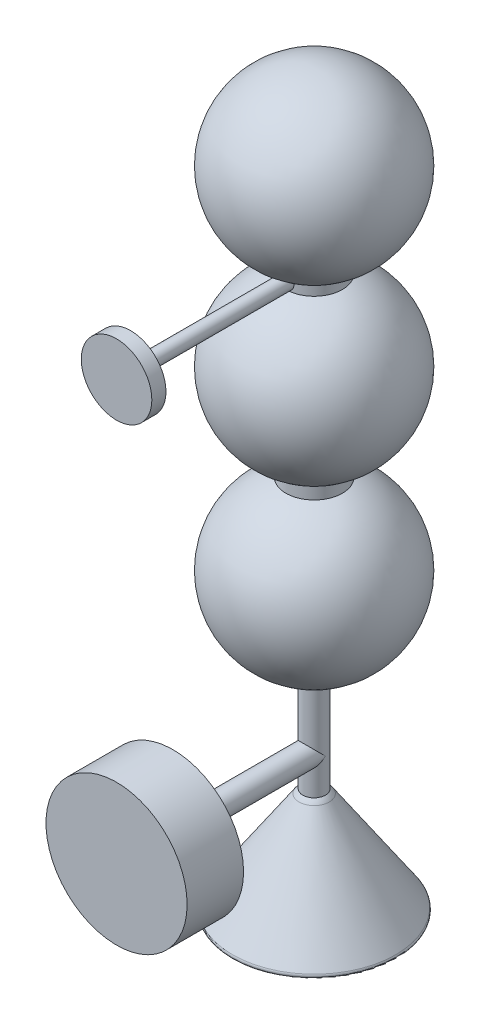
from build123d import *

# Parameters (mm, degrees)
CROQUIS2_R              = 8
SALIENTE_EXTRUIR2_DEPTH = 150
CROQUIS6_W              = 20
CROQUIS6_H              = 10
MATRIZL1_COUNT          = 2
MATRIZL1_PITCH          = 125
CROQUIS8_R              = 8
SALIENTE_EXTRUIR3_DEPTH = 100
CROQUIS9_R              = 50
SALIENTE_EXTRUIR4_DEPTH = 40
CROQUIS10_R             = 5
SALIENTE_EXTRUIR5_DEPTH = 130
CROQUIS11_R             = 25
SALIENTE_EXTRUIR6_DEPTH = 10
REDONDEO2_R             = 2


with BuildPart() as part:
    # Croquis2 → Saliente-Extruir2 (new body)
    with BuildSketch(Plane(origin=(0, 0, 0), x_dir=(1, 0, 0), z_dir=(0, 1, 0))):
        with Locations(Location((0, 0, 0), (0, 0, 270))):
            Circle(CROQUIS2_R)
    extrude(amount=SALIENTE_EXTRUIR2_DEPTH)

    # Croquis8 → Saliente-Extruir3 (add)
    with BuildSketch(Plane.XY):
        with Locations((0, 100)):
            Circle(CROQUIS8_R)
    extrude(amount=SALIENTE_EXTRUIR3_DEPTH)


with BuildPart() as body_2:
    # Croquis3 → Revoluci_n1 (revolve)
    with BuildSketch(Plane.XY):
        with BuildLine():
            Line((0, 150), (0, 270))
            ThreePointArc((0, 270), (-60, 210), (0, 150))
        make_face()
    revolve(axis=Axis((0, 1237.246790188, 0), (0, -1, 0)))


with BuildPart() as body_3:
    # Croquis6 → Revoluci_n3 (revolve)
    with BuildSketch(Plane.XY, mode=Mode.PRIVATE) as revoluci_n3_sk:
        with Locations((-10, 272.298188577)):
            Rectangle(CROQUIS6_W, CROQUIS6_H)
    revolve(revoluci_n3_sk.sketch.rotate(Axis((0, 253.613765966, 0), (0, 1, 0)), 270), axis=Axis((0, 253.613765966, 0), (0, 1, 0)))


with BuildPart() as matrizl1_1:
    # MatrizL1: pattern copy
    add(body_2.part.moved(Location(Vector(0, 1, 0) * (1 * MATRIZL1_PITCH))))


with BuildPart() as matrizl1_2:
    # MatrizL1: pattern copy
    add(body_3.part.moved(Location(Vector(0, 1, 0) * (1 * MATRIZL1_PITCH))))


with BuildPart() as body_6:
    # Croquis7 → Revoluci_n4 (revolve)
    with BuildSketch(Plane.XY):
        with BuildLine():
            Line((0, 398.290277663), (0, 518.290277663))
            ThreePointArc((0, 518.290277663), (-60, 458.290277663), (0, 398.290277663))
        make_face()
    revolve(axis=Axis((0, 398.290277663, 0), (0, 1, 0)))


with BuildPart() as body_7:
    # Croquis9 → Saliente-Extruir4 (new body)
    with BuildSketch(Plane.XY.offset(100)):
        with Locations((0, 100)):
            Circle(CROQUIS9_R)
    extrude(amount=SALIENTE_EXTRUIR4_DEPTH)


with BuildPart() as body_8:
    # Croquis10 → Saliente-Extruir5 (new body)
    with BuildSketch(Plane.XY):
        with Locations((0, 397.116670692)):
            Circle(CROQUIS10_R)
    extrude(amount=SALIENTE_EXTRUIR5_DEPTH)


with BuildPart() as body_9:
    # Croquis11 → Saliente-Extruir6 (new body)
    with BuildSketch(Plane.XY.offset(130)):
        with Locations((0, 397.116670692)):
            Circle(CROQUIS11_R)
    extrude(amount=SALIENTE_EXTRUIR6_DEPTH)


with BuildPart() as body_10:
    # Croquis5 → Revoluci_n2 (revolve)
    with BuildSketch(Plane.XY, mode=Mode.PRIVATE) as revoluci_n2_sk:
        with BuildLine():
            Line((0, 0), (-60, 0))
            Line((-60, 0), (-10.651687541, 73.161881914))
            ThreePointArc((-10.651687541, 73.161881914), (-6.030802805, 77.679050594), (0, 80))
            Line((0, 80), (0, 0))
        make_face()
    revolve(revoluci_n2_sk.sketch.rotate(Axis((0, 0, 0), (0, 1, 0)), 180), axis=Axis((0, 0, 0), (0, 1, 0)))

    # Redondeo2
    redondeo2_edges = [body_10.edges().sort_by_distance(p)[0] for p in [
        (-60, 0, 0),
    ]]
    fillet(redondeo2_edges, radius=REDONDEO2_R)


solid = Compound([part.part, body_2.part, body_3.part, matrizl1_1.part, matrizl1_2.part, body_6.part, body_7.part, body_8.part, body_9.part, body_10.part])
